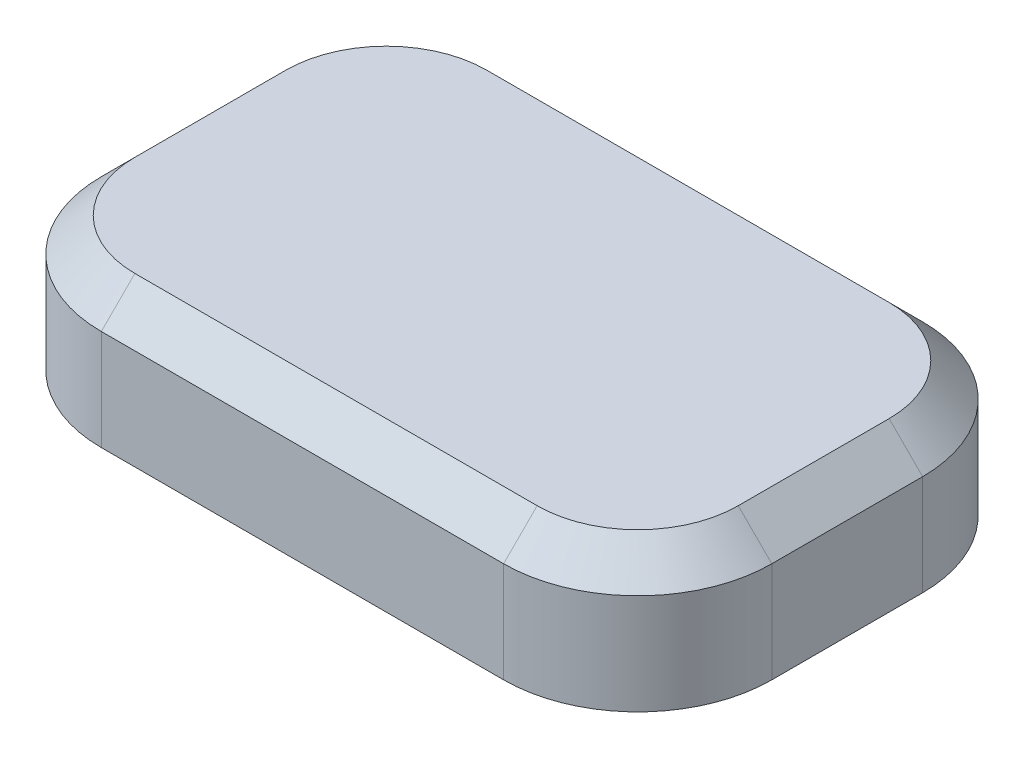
from build123d import *

# Parameters (mm, degrees)
SKETCH1_W      = 200
SKETCH1_H      = 125
EXTRUDE1_DEPTH = 40
FILLET1_R      = 40
CHAMFER2_SIZE  = 10


with BuildPart() as part:
    # Sketch1 → Extrude1 (new body)
    with BuildSketch(Plane(origin=(0, 0, 0), x_dir=(1, 0, 0), z_dir=(0, 1, 0))):
        Rectangle(SKETCH1_W, SKETCH1_H)
    extrude(amount=EXTRUDE1_DEPTH)

    # Fillet1
    fillet1_edges = [part.edges().sort_by_distance(p)[0] for p in [
        (-100, 20, -62.5),
        (100, 20, -62.5),
        (100, 20, 62.5),
        (-100, 20, 62.5),
    ]]
    fillet(fillet1_edges, radius=FILLET1_R)

    # Chamfer2
    chamfer2_edges = [part.edges().sort_by_distance(p)[0] for p in [
        (-100, 40, 0),
        (0, 40, -62.5),
        (0, 40, 62.5),
        (100, 40, 0),
        (88.284271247, 40, 50.784271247),
        (88.284271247, 40, -50.784271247),
        (-88.284271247, 40, 50.784271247),
        (-88.284271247, 40, -50.784271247),
    ]]
    chamfer(chamfer2_edges, length=CHAMFER2_SIZE)


solid = part.part
